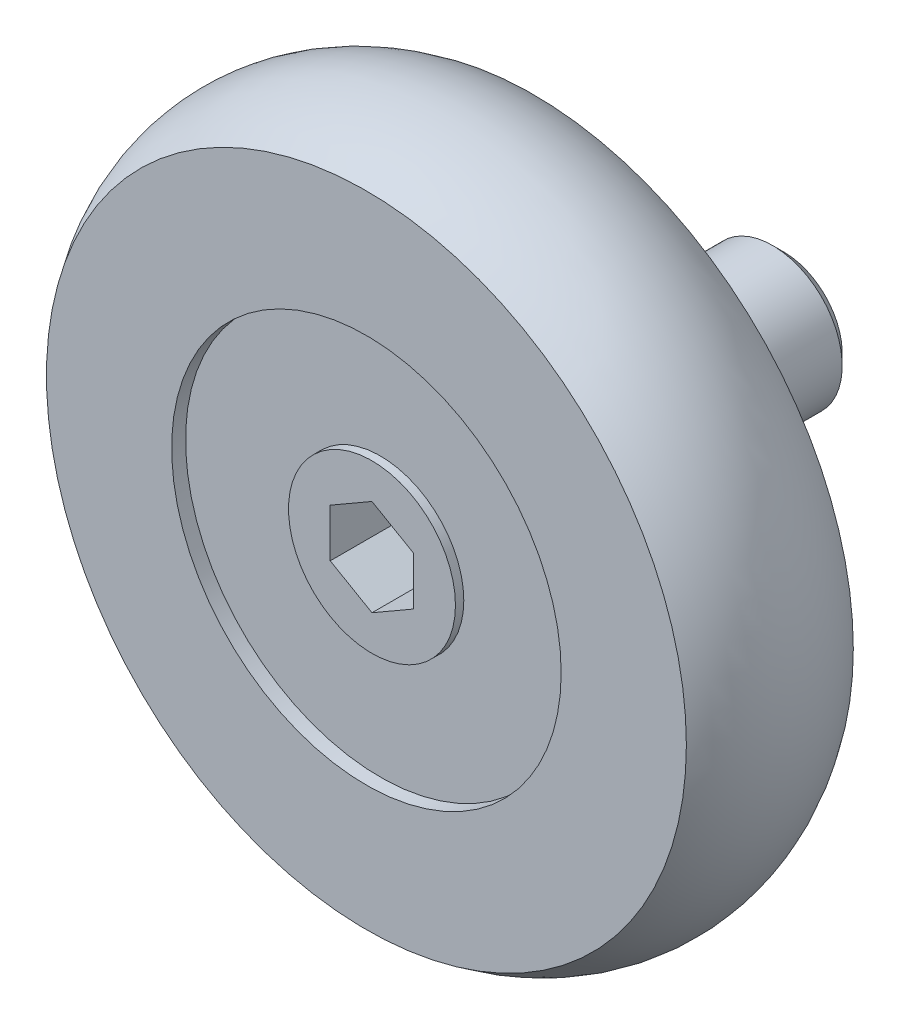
ISO-10303-21;
HEADER;
FILE_DESCRIPTION(('STEP AP214'),'2;1');
FILE_NAME('part.step','',(''),(''),'','','');
FILE_SCHEMA(('AUTOMOTIVE_DESIGN { 1 0 10303 214 1 1 1 1 }'));
ENDSEC;
DATA;
#1=APPLICATION_CONTEXT('core data for automotive mechanical design processes');
#2=APPLICATION_PROTOCOL_DEFINITION('international standard','automotive_design',2000,#1);
#3=PRODUCT_CONTEXT('',#1,'mechanical');
#4=PRODUCT('Part','Part','',(#3));
#5=PRODUCT_RELATED_PRODUCT_CATEGORY('part','',(#4));
#6=PRODUCT_DEFINITION_FORMATION('','',#4);
#7=PRODUCT_DEFINITION_CONTEXT('part definition',#1,'design');
#8=PRODUCT_DEFINITION('design','',#6,#7);
#9=PRODUCT_DEFINITION_SHAPE('','',#8);
#10=(LENGTH_UNIT() NAMED_UNIT(*) SI_UNIT(.MILLI.,.METRE.));
#11=(NAMED_UNIT(*) PLANE_ANGLE_UNIT() SI_UNIT($,.RADIAN.));
#12=(NAMED_UNIT(*) SI_UNIT($,.STERADIAN.) SOLID_ANGLE_UNIT());
#13=UNCERTAINTY_MEASURE_WITH_UNIT(LENGTH_MEASURE(1.E-05),#10,'distance_accuracy_value','');
#14=(GEOMETRIC_REPRESENTATION_CONTEXT(3) GLOBAL_UNCERTAINTY_ASSIGNED_CONTEXT((#13)) GLOBAL_UNIT_ASSIGNED_CONTEXT((#10,
#11,#12)) REPRESENTATION_CONTEXT('',''));
#15=CARTESIAN_POINT('',(0.,0.,0.));
#16=DIRECTION('',(0.,0.,1.));
#17=DIRECTION('',(1.,0.,0.));
#18=AXIS2_PLACEMENT_3D('',#15,#16,#17);
#19=CARTESIAN_POINT('',(0.,4.,0.));
#20=DIRECTION('',(0.,0.,1.));
#21=DIRECTION('',(1.,0.,0.));
#22=AXIS2_PLACEMENT_3D('',#19,#20,#21);
#23=PLANE('',#22);
#24=CARTESIAN_POINT('',(0.,0.,0.));
#25=DIRECTION('',(0.,0.,1.));
#26=DIRECTION('',(1.,0.,0.));
#27=AXIS2_PLACEMENT_3D('',#24,#25,#26);
#28=CIRCLE('',#27,4.);
#29=CARTESIAN_POINT('',(4.,0.,0.));
#30=VERTEX_POINT('',#29);
#31=EDGE_CURVE('E9',#30,#30,#28,.T.);
#32=ORIENTED_EDGE('',*,*,#31,.F.);
#33=EDGE_LOOP('',(#32));
#34=FACE_BOUND('',#33,.T.);
#35=CARTESIAN_POINT('',(0.,0.,0.));
#36=DIRECTION('',(0.,0.,-1.));
#37=DIRECTION('',(-1.,0.,0.));
#38=AXIS2_PLACEMENT_3D('',#35,#36,#37);
#39=CIRCLE('',#38,2.);
#40=CARTESIAN_POINT('',(-2.,0.,0.));
#41=VERTEX_POINT('',#40);
#42=EDGE_CURVE('E104',#41,#41,#39,.T.);
#43=ORIENTED_EDGE('',*,*,#42,.F.);
#44=EDGE_LOOP('',(#43));
#45=FACE_BOUND('',#44,.T.);
#46=ADVANCED_FACE('F14',(#34,#45),#23,.F.);
#47=CARTESIAN_POINT('',(0.,0.,10.));
#48=DIRECTION('',(0.,0.,1.));
#49=DIRECTION('',(1.,0.,0.));
#50=AXIS2_PLACEMENT_3D('',#47,#48,#49);
#51=CYLINDRICAL_SURFACE('',#50,4.);
#52=CARTESIAN_POINT('',(0.,0.,1.5));
#53=DIRECTION('',(0.,0.,1.));
#54=DIRECTION('',(1.,0.,0.));
#55=AXIS2_PLACEMENT_3D('',#52,#53,#54);
#56=CIRCLE('',#55,4.);
#57=CARTESIAN_POINT('',(4.,0.,1.5));
#58=VERTEX_POINT('',#57);
#59=EDGE_CURVE('E22',#58,#58,#56,.T.);
#60=ORIENTED_EDGE('',*,*,#59,.F.);
#61=EDGE_LOOP('',(#60));
#62=FACE_BOUND('',#61,.T.);
#63=ORIENTED_EDGE('',*,*,#31,.T.);
#64=EDGE_LOOP('',(#63));
#65=FACE_BOUND('',#64,.T.);
#66=ADVANCED_FACE('F150',(#62,#65),#51,.T.);
#67=CARTESIAN_POINT('',(0.,4.,1.5));
#68=DIRECTION('',(0.,0.,1.));
#69=DIRECTION('',(1.,0.,0.));
#70=AXIS2_PLACEMENT_3D('',#67,#68,#69);
#71=PLANE('',#70);
#72=CARTESIAN_POINT('',(0.,0.,1.5));
#73=DIRECTION('',(0.,0.,1.));
#74=DIRECTION('',(1.,0.,0.));
#75=AXIS2_PLACEMENT_3D('',#72,#73,#74);
#76=CIRCLE('',#75,7.);
#77=CARTESIAN_POINT('',(7.,0.,1.5));
#78=VERTEX_POINT('',#77);
#79=EDGE_CURVE('E143',#78,#78,#76,.T.);
#80=ORIENTED_EDGE('',*,*,#79,.F.);
#81=EDGE_LOOP('',(#80));
#82=FACE_BOUND('',#81,.T.);
#83=ORIENTED_EDGE('',*,*,#59,.T.);
#84=EDGE_LOOP('',(#83));
#85=FACE_BOUND('',#84,.T.);
#86=ADVANCED_FACE('F148',(#82,#85),#71,.F.);
#87=CARTESIAN_POINT('',(0.,0.,10.));
#88=DIRECTION('',(0.,0.,1.));
#89=DIRECTION('',(1.,0.,0.));
#90=AXIS2_PLACEMENT_3D('',#87,#88,#89);
#91=CYLINDRICAL_SURFACE('',#90,7.);
#92=CARTESIAN_POINT('',(0.,0.,1.));
#93=DIRECTION('',(0.,0.,1.));
#94=DIRECTION('',(1.,0.,0.));
#95=AXIS2_PLACEMENT_3D('',#92,#93,#94);
#96=CIRCLE('',#95,7.);
#97=CARTESIAN_POINT('',(7.,0.,1.));
#98=VERTEX_POINT('',#97);
#99=EDGE_CURVE('E140',#98,#98,#96,.T.);
#100=ORIENTED_EDGE('',*,*,#99,.F.);
#101=EDGE_LOOP('',(#100));
#102=FACE_BOUND('',#101,.T.);
#103=ORIENTED_EDGE('',*,*,#79,.T.);
#104=EDGE_LOOP('',(#103));
#105=FACE_BOUND('',#104,.T.);
#106=ADVANCED_FACE('F223',(#102,#105),#91,.F.);
#107=CARTESIAN_POINT('',(0.,11.5,1.));
#108=DIRECTION('',(0.,0.,1.));
#109=DIRECTION('',(1.,0.,0.));
#110=AXIS2_PLACEMENT_3D('',#107,#108,#109);
#111=PLANE('',#110);
#112=CARTESIAN_POINT('',(0.,0.,1.));
#113=DIRECTION('',(0.,0.,1.));
#114=DIRECTION('',(1.,0.,0.));
#115=AXIS2_PLACEMENT_3D('',#112,#113,#114);
#116=CIRCLE('',#115,11.5);
#117=CARTESIAN_POINT('',(11.5,0.,1.));
#118=VERTEX_POINT('',#117);
#119=EDGE_CURVE('E137',#118,#118,#116,.T.);
#120=ORIENTED_EDGE('',*,*,#119,.F.);
#121=EDGE_LOOP('',(#120));
#122=FACE_BOUND('',#121,.T.);
#123=ORIENTED_EDGE('',*,*,#99,.T.);
#124=EDGE_LOOP('',(#123));
#125=FACE_BOUND('',#124,.T.);
#126=ADVANCED_FACE('F219',(#122,#125),#111,.F.);
#127=CARTESIAN_POINT('',(0.,0.,4.));
#128=DIRECTION('',(0.,0.,1.));
#129=DIRECTION('',(1.,0.,0.));
#130=AXIS2_PLACEMENT_3D('',#127,#128,#129);
#131=TOROIDAL_SURFACE('',#130,7.5,5.);
#132=CARTESIAN_POINT('',(0.,0.,7.));
#133=DIRECTION('',(0.,0.,1.));
#134=DIRECTION('',(1.,0.,0.));
#135=AXIS2_PLACEMENT_3D('',#132,#133,#134);
#136=CIRCLE('',#135,11.5);
#137=CARTESIAN_POINT('',(11.5,0.,7.));
#138=VERTEX_POINT('',#137);
#139=EDGE_CURVE('E134',#138,#138,#136,.T.);
#140=ORIENTED_EDGE('',*,*,#139,.F.);
#141=EDGE_LOOP('',(#140));
#142=FACE_BOUND('',#141,.T.);
#143=ORIENTED_EDGE('',*,*,#119,.T.);
#144=EDGE_LOOP('',(#143));
#145=FACE_BOUND('',#144,.T.);
#146=ADVANCED_FACE('F215',(#142,#145),#131,.T.);
#147=CARTESIAN_POINT('',(0.,11.5,7.));
#148=DIRECTION('',(0.,0.,-1.));
#149=DIRECTION('',(-1.,0.,0.));
#150=AXIS2_PLACEMENT_3D('',#147,#148,#149);
#151=PLANE('',#150);
#152=CARTESIAN_POINT('',(0.,0.,7.));
#153=DIRECTION('',(0.,0.,1.));
#154=DIRECTION('',(1.,0.,0.));
#155=AXIS2_PLACEMENT_3D('',#152,#153,#154);
#156=CIRCLE('',#155,7.);
#157=CARTESIAN_POINT('',(7.,0.,7.));
#158=VERTEX_POINT('',#157);
#159=EDGE_CURVE('E131',#158,#158,#156,.T.);
#160=ORIENTED_EDGE('',*,*,#159,.F.);
#161=EDGE_LOOP('',(#160));
#162=FACE_BOUND('',#161,.T.);
#163=ORIENTED_EDGE('',*,*,#139,.T.);
#164=EDGE_LOOP('',(#163));
#165=FACE_BOUND('',#164,.T.);
#166=ADVANCED_FACE('F211',(#162,#165),#151,.F.);
#167=CARTESIAN_POINT('',(0.,0.,10.));
#168=DIRECTION('',(0.,0.,1.));
#169=DIRECTION('',(1.,0.,0.));
#170=AXIS2_PLACEMENT_3D('',#167,#168,#169);
#171=CYLINDRICAL_SURFACE('',#170,7.);
#172=CARTESIAN_POINT('',(0.,0.,6.5));
#173=DIRECTION('',(0.,0.,1.));
#174=DIRECTION('',(1.,0.,0.));
#175=AXIS2_PLACEMENT_3D('',#172,#173,#174);
#176=CIRCLE('',#175,7.);
#177=CARTESIAN_POINT('',(7.,0.,6.5));
#178=VERTEX_POINT('',#177);
#179=EDGE_CURVE('E128',#178,#178,#176,.T.);
#180=ORIENTED_EDGE('',*,*,#179,.F.);
#181=EDGE_LOOP('',(#180));
#182=FACE_BOUND('',#181,.T.);
#183=ORIENTED_EDGE('',*,*,#159,.T.);
#184=EDGE_LOOP('',(#183));
#185=FACE_BOUND('',#184,.T.);
#186=ADVANCED_FACE('F207',(#182,#185),#171,.F.);
#187=CARTESIAN_POINT('',(0.,3.,6.5));
#188=DIRECTION('',(0.,0.,-1.));
#189=DIRECTION('',(-1.,0.,0.));
#190=AXIS2_PLACEMENT_3D('',#187,#188,#189);
#191=PLANE('',#190);
#192=CARTESIAN_POINT('',(0.,0.,6.5));
#193=DIRECTION('',(0.,0.,1.));
#194=DIRECTION('',(1.,0.,0.));
#195=AXIS2_PLACEMENT_3D('',#192,#193,#194);
#196=CIRCLE('',#195,3.);
#197=CARTESIAN_POINT('',(3.,0.,6.5));
#198=VERTEX_POINT('',#197);
#199=EDGE_CURVE('E125',#198,#198,#196,.T.);
#200=ORIENTED_EDGE('',*,*,#199,.F.);
#201=EDGE_LOOP('',(#200));
#202=FACE_BOUND('',#201,.T.);
#203=ORIENTED_EDGE('',*,*,#179,.T.);
#204=EDGE_LOOP('',(#203));
#205=FACE_BOUND('',#204,.T.);
#206=ADVANCED_FACE('F203',(#202,#205),#191,.F.);
#207=CARTESIAN_POINT('',(0.,0.,10.));
#208=DIRECTION('',(0.,0.,1.));
#209=DIRECTION('',(1.,0.,0.));
#210=AXIS2_PLACEMENT_3D('',#207,#208,#209);
#211=CYLINDRICAL_SURFACE('',#210,3.);
#212=CARTESIAN_POINT('',(0.,0.,6.8));
#213=DIRECTION('',(0.,0.,1.));
#214=DIRECTION('',(1.,0.,0.));
#215=AXIS2_PLACEMENT_3D('',#212,#213,#214);
#216=CIRCLE('',#215,3.);
#217=CARTESIAN_POINT('',(3.,0.,6.8));
#218=VERTEX_POINT('',#217);
#219=EDGE_CURVE('E117',#218,#218,#216,.T.);
#220=ORIENTED_EDGE('',*,*,#219,.F.);
#221=EDGE_LOOP('',(#220));
#222=FACE_BOUND('',#221,.T.);
#223=ORIENTED_EDGE('',*,*,#199,.T.);
#224=EDGE_LOOP('',(#223));
#225=FACE_BOUND('',#224,.T.);
#226=ADVANCED_FACE('F200',(#222,#225),#211,.T.);
#227=CARTESIAN_POINT('',(0.,3.,6.8));
#228=DIRECTION('',(0.,0.,-1.));
#229=DIRECTION('',(-1.,0.,0.));
#230=AXIS2_PLACEMENT_3D('',#227,#228,#229);
#231=PLANE('',#230);
#232=DIRECTION('',(-0.866025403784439,-0.5,0.));
#233=VECTOR('',#232,1.);
#234=CARTESIAN_POINT('',(0.,1.73205080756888,6.8));
#235=LINE('',#234,#233);
#236=CARTESIAN_POINT('',(0.,1.73205080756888,6.8));
#237=VERTEX_POINT('',#236);
#238=CARTESIAN_POINT('',(-1.5,0.866025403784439,6.8));
#239=VERTEX_POINT('',#238);
#240=EDGE_CURVE('E103',#237,#239,#235,.T.);
#241=ORIENTED_EDGE('',*,*,#240,.F.);
#242=DIRECTION('',(-0.866025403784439,0.5,0.));
#243=VECTOR('',#242,1.);
#244=CARTESIAN_POINT('',(1.5,0.86602540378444,6.8));
#245=LINE('',#244,#243);
#246=CARTESIAN_POINT('',(1.5,0.86602540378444,6.8));
#247=VERTEX_POINT('',#246);
#248=EDGE_CURVE('E29',#247,#237,#245,.T.);
#249=ORIENTED_EDGE('',*,*,#248,.F.);
#250=DIRECTION('',(0.,1.,0.));
#251=VECTOR('',#250,1.);
#252=CARTESIAN_POINT('',(1.5,-0.866025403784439,6.8));
#253=LINE('',#252,#251);
#254=CARTESIAN_POINT('',(1.5,-0.866025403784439,6.8));
#255=VERTEX_POINT('',#254);
#256=EDGE_CURVE('E113',#255,#247,#253,.T.);
#257=ORIENTED_EDGE('',*,*,#256,.F.);
#258=DIRECTION('',(0.866025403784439,0.5,0.));
#259=VECTOR('',#258,1.);
#260=CARTESIAN_POINT('',(0.,-1.73205080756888,6.8));
#261=LINE('',#260,#259);
#262=CARTESIAN_POINT('',(0.,-1.73205080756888,6.8));
#263=VERTEX_POINT('',#262);
#264=EDGE_CURVE('E111',#263,#255,#261,.T.);
#265=ORIENTED_EDGE('',*,*,#264,.F.);
#266=DIRECTION('',(0.866025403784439,-0.5,0.));
#267=VECTOR('',#266,1.);
#268=CARTESIAN_POINT('',(-1.5,-0.866025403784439,6.8));
#269=LINE('',#268,#267);
#270=CARTESIAN_POINT('',(-1.5,-0.866025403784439,6.8));
#271=VERTEX_POINT('',#270);
#272=EDGE_CURVE('E77',#271,#263,#269,.T.);
#273=ORIENTED_EDGE('',*,*,#272,.F.);
#274=DIRECTION('',(0.,-1.,0.));
#275=VECTOR('',#274,1.);
#276=CARTESIAN_POINT('',(-1.5,0.866025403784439,6.8));
#277=LINE('',#276,#275);
#278=EDGE_CURVE('E107',#239,#271,#277,.T.);
#279=ORIENTED_EDGE('',*,*,#278,.F.);
#280=EDGE_LOOP('',(#241,#249,#257,#265,#273,#279));
#281=FACE_BOUND('',#280,.T.);
#282=ORIENTED_EDGE('',*,*,#219,.T.);
#283=EDGE_LOOP('',(#282));
#284=FACE_BOUND('',#283,.T.);
#285=ADVANCED_FACE('F175',(#281,#284),#231,.F.);
#286=CARTESIAN_POINT('',(1.5,0.86602540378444,4.3));
#287=DIRECTION('',(0.5,0.866025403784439,0.));
#288=DIRECTION('',(-0.866025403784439,0.5,0.));
#289=AXIS2_PLACEMENT_3D('',#286,#287,#288);
#290=PLANE('',#289);
#291=ORIENTED_EDGE('',*,*,#248,.T.);
#292=DIRECTION('',(0.,0.,1.));
#293=VECTOR('',#292,1.);
#294=CARTESIAN_POINT('',(0.,1.73205080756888,4.3));
#295=LINE('',#294,#293);
#296=CARTESIAN_POINT('',(0.,1.73205080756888,4.3));
#297=VERTEX_POINT('',#296);
#298=EDGE_CURVE('E59',#297,#237,#295,.T.);
#299=ORIENTED_EDGE('',*,*,#298,.F.);
#300=DIRECTION('',(-0.866025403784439,0.5,0.));
#301=VECTOR('',#300,1.);
#302=CARTESIAN_POINT('',(1.5,0.86602540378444,4.3));
#303=LINE('',#302,#301);
#304=CARTESIAN_POINT('',(1.5,0.86602540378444,4.3));
#305=VERTEX_POINT('',#304);
#306=EDGE_CURVE('E115',#305,#297,#303,.T.);
#307=ORIENTED_EDGE('',*,*,#306,.F.);
#308=DIRECTION('',(0.,0.,1.));
#309=VECTOR('',#308,1.);
#310=CARTESIAN_POINT('',(1.5,0.86602540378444,4.3));
#311=LINE('',#310,#309);
#312=EDGE_CURVE('E37',#305,#247,#311,.T.);
#313=ORIENTED_EDGE('',*,*,#312,.T.);
#314=EDGE_LOOP('',(#291,#299,#307,#313));
#315=FACE_BOUND('',#314,.T.);
#316=ADVANCED_FACE('F180',(#315),#290,.F.);
#317=CARTESIAN_POINT('',(1.5,-0.866025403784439,4.3));
#318=DIRECTION('',(1.,0.,0.));
#319=DIRECTION('',(0.,1.,0.));
#320=AXIS2_PLACEMENT_3D('',#317,#318,#319);
#321=PLANE('',#320);
#322=ORIENTED_EDGE('',*,*,#256,.T.);
#323=ORIENTED_EDGE('',*,*,#312,.F.);
#324=DIRECTION('',(0.,1.,0.));
#325=VECTOR('',#324,1.);
#326=CARTESIAN_POINT('',(1.5,-0.866025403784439,4.3));
#327=LINE('',#326,#325);
#328=CARTESIAN_POINT('',(1.5,-0.866025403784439,4.3));
#329=VERTEX_POINT('',#328);
#330=EDGE_CURVE('E89',#329,#305,#327,.T.);
#331=ORIENTED_EDGE('',*,*,#330,.F.);
#332=DIRECTION('',(0.,0.,1.));
#333=VECTOR('',#332,1.);
#334=CARTESIAN_POINT('',(1.5,-0.866025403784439,4.3));
#335=LINE('',#334,#333);
#336=EDGE_CURVE('E81',#329,#255,#335,.T.);
#337=ORIENTED_EDGE('',*,*,#336,.T.);
#338=EDGE_LOOP('',(#322,#323,#331,#337));
#339=FACE_BOUND('',#338,.T.);
#340=ADVANCED_FACE('F178',(#339),#321,.F.);
#341=CARTESIAN_POINT('',(0.,-1.73205080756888,4.3));
#342=DIRECTION('',(0.5,-0.866025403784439,0.));
#343=DIRECTION('',(0.866025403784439,0.5,0.));
#344=AXIS2_PLACEMENT_3D('',#341,#342,#343);
#345=PLANE('',#344);
#346=ORIENTED_EDGE('',*,*,#264,.T.);
#347=ORIENTED_EDGE('',*,*,#336,.F.);
#348=DIRECTION('',(0.866025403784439,0.5,0.));
#349=VECTOR('',#348,1.);
#350=CARTESIAN_POINT('',(0.,-1.73205080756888,4.3));
#351=LINE('',#350,#349);
#352=CARTESIAN_POINT('',(0.,-1.73205080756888,4.3));
#353=VERTEX_POINT('',#352);
#354=EDGE_CURVE('E85',#353,#329,#351,.T.);
#355=ORIENTED_EDGE('',*,*,#354,.F.);
#356=DIRECTION('',(0.,0.,1.));
#357=VECTOR('',#356,1.);
#358=CARTESIAN_POINT('',(0.,-1.73205080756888,4.3));
#359=LINE('',#358,#357);
#360=EDGE_CURVE('E70',#353,#263,#359,.T.);
#361=ORIENTED_EDGE('',*,*,#360,.T.);
#362=EDGE_LOOP('',(#346,#347,#355,#361));
#363=FACE_BOUND('',#362,.T.);
#364=ADVANCED_FACE('F86',(#363),#345,.F.);
#365=CARTESIAN_POINT('',(-1.5,-0.866025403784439,4.3));
#366=DIRECTION('',(-0.5,-0.866025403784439,0.));
#367=DIRECTION('',(0.866025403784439,-0.5,0.));
#368=AXIS2_PLACEMENT_3D('',#365,#366,#367);
#369=PLANE('',#368);
#370=ORIENTED_EDGE('',*,*,#272,.T.);
#371=ORIENTED_EDGE('',*,*,#360,.F.);
#372=DIRECTION('',(0.866025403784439,-0.5,0.));
#373=VECTOR('',#372,1.);
#374=CARTESIAN_POINT('',(-1.5,-0.866025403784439,4.3));
#375=LINE('',#374,#373);
#376=CARTESIAN_POINT('',(-1.5,-0.866025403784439,4.3));
#377=VERTEX_POINT('',#376);
#378=EDGE_CURVE('E74',#377,#353,#375,.T.);
#379=ORIENTED_EDGE('',*,*,#378,.F.);
#380=DIRECTION('',(0.,0.,1.));
#381=VECTOR('',#380,1.);
#382=CARTESIAN_POINT('',(-1.5,-0.866025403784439,4.3));
#383=LINE('',#382,#381);
#384=EDGE_CURVE('E82',#377,#271,#383,.T.);
#385=ORIENTED_EDGE('',*,*,#384,.T.);
#386=EDGE_LOOP('',(#370,#371,#379,#385));
#387=FACE_BOUND('',#386,.T.);
#388=ADVANCED_FACE('F72',(#387),#369,.F.);
#389=CARTESIAN_POINT('',(-1.5,0.866025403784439,4.3));
#390=DIRECTION('',(-1.,0.,0.));
#391=DIRECTION('',(0.,-1.,0.));
#392=AXIS2_PLACEMENT_3D('',#389,#390,#391);
#393=PLANE('',#392);
#394=ORIENTED_EDGE('',*,*,#278,.T.);
#395=ORIENTED_EDGE('',*,*,#384,.F.);
#396=DIRECTION('',(0.,-1.,0.));
#397=VECTOR('',#396,1.);
#398=CARTESIAN_POINT('',(-1.5,0.866025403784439,4.3));
#399=LINE('',#398,#397);
#400=CARTESIAN_POINT('',(-1.5,0.866025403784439,4.3));
#401=VERTEX_POINT('',#400);
#402=EDGE_CURVE('E95',#401,#377,#399,.T.);
#403=ORIENTED_EDGE('',*,*,#402,.F.);
#404=DIRECTION('',(0.,0.,1.));
#405=VECTOR('',#404,1.);
#406=CARTESIAN_POINT('',(-1.5,0.866025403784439,4.3));
#407=LINE('',#406,#405);
#408=EDGE_CURVE('E120',#401,#239,#407,.T.);
#409=ORIENTED_EDGE('',*,*,#408,.T.);
#410=EDGE_LOOP('',(#394,#395,#403,#409));
#411=FACE_BOUND('',#410,.T.);
#412=ADVANCED_FACE('F173',(#411),#393,.F.);
#413=CARTESIAN_POINT('',(0.,1.73205080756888,4.3));
#414=DIRECTION('',(-0.5,0.866025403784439,0.));
#415=DIRECTION('',(-0.866025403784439,-0.5,0.));
#416=AXIS2_PLACEMENT_3D('',#413,#414,#415);
#417=PLANE('',#416);
#418=ORIENTED_EDGE('',*,*,#240,.T.);
#419=ORIENTED_EDGE('',*,*,#408,.F.);
#420=DIRECTION('',(-0.866025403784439,-0.5,0.));
#421=VECTOR('',#420,1.);
#422=CARTESIAN_POINT('',(0.,1.73205080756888,4.3));
#423=LINE('',#422,#421);
#424=EDGE_CURVE('E97',#297,#401,#423,.T.);
#425=ORIENTED_EDGE('',*,*,#424,.F.);
#426=ORIENTED_EDGE('',*,*,#298,.T.);
#427=EDGE_LOOP('',(#418,#419,#425,#426));
#428=FACE_BOUND('',#427,.T.);
#429=ADVANCED_FACE('F169',(#428),#417,.F.);
#430=CARTESIAN_POINT('',(0.,0.,4.3));
#431=DIRECTION('',(0.,0.,1.));
#432=DIRECTION('',(1.,0.,0.));
#433=AXIS2_PLACEMENT_3D('',#430,#431,#432);
#434=PLANE('',#433);
#435=ORIENTED_EDGE('',*,*,#306,.T.);
#436=ORIENTED_EDGE('',*,*,#424,.T.);
#437=ORIENTED_EDGE('',*,*,#402,.T.);
#438=ORIENTED_EDGE('',*,*,#378,.T.);
#439=ORIENTED_EDGE('',*,*,#354,.T.);
#440=ORIENTED_EDGE('',*,*,#330,.T.);
#441=EDGE_LOOP('',(#435,#436,#437,#438,#439,#440));
#442=FACE_BOUND('',#441,.T.);
#443=ADVANCED_FACE('F92',(#442),#434,.T.);
#444=CARTESIAN_POINT('',(0.,0.,-8.));
#445=DIRECTION('',(0.,0.,-1.));
#446=DIRECTION('',(-1.,0.,0.));
#447=AXIS2_PLACEMENT_3D('',#444,#445,#446);
#448=CYLINDRICAL_SURFACE('',#447,2.);
#449=CARTESIAN_POINT('',(0.,0.,-1.6));
#450=DIRECTION('',(0.,0.,-1.));
#451=DIRECTION('',(-1.,0.,0.));
#452=AXIS2_PLACEMENT_3D('',#449,#450,#451);
#453=CIRCLE('',#452,2.);
#454=CARTESIAN_POINT('',(-2.,0.,-1.6));
#455=VERTEX_POINT('',#454);
#456=EDGE_CURVE('E161',#455,#455,#453,.T.);
#457=ORIENTED_EDGE('',*,*,#456,.F.);
#458=EDGE_LOOP('',(#457));
#459=FACE_BOUND('',#458,.T.);
#460=ORIENTED_EDGE('',*,*,#42,.T.);
#461=EDGE_LOOP('',(#460));
#462=FACE_BOUND('',#461,.T.);
#463=ADVANCED_FACE('F325',(#459,#462),#448,.T.);
#464=CARTESIAN_POINT('',(0.,2.,-1.6));
#465=DIRECTION('',(0.,0.,-1.));
#466=DIRECTION('',(-1.,0.,0.));
#467=AXIS2_PLACEMENT_3D('',#464,#465,#466);
#468=PLANE('',#467);
#469=CARTESIAN_POINT('',(0.,0.,-1.6));
#470=DIRECTION('',(0.,0.,-1.));
#471=DIRECTION('',(-1.,0.,0.));
#472=AXIS2_PLACEMENT_3D('',#469,#470,#471);
#473=CIRCLE('',#472,2.5);
#474=CARTESIAN_POINT('',(-2.5,0.,-1.6));
#475=VERTEX_POINT('',#474);
#476=EDGE_CURVE('E164',#475,#475,#473,.T.);
#477=ORIENTED_EDGE('',*,*,#476,.F.);
#478=EDGE_LOOP('',(#477));
#479=FACE_BOUND('',#478,.T.);
#480=ORIENTED_EDGE('',*,*,#456,.T.);
#481=EDGE_LOOP('',(#480));
#482=FACE_BOUND('',#481,.T.);
#483=ADVANCED_FACE('F334',(#479,#482),#468,.F.);
#484=CARTESIAN_POINT('',(0.,0.,-8.));
#485=DIRECTION('',(0.,0.,-1.));
#486=DIRECTION('',(-1.,0.,0.));
#487=AXIS2_PLACEMENT_3D('',#484,#485,#486);
#488=CYLINDRICAL_SURFACE('',#487,2.5);
#489=CARTESIAN_POINT('',(0.,0.,-7.6));
#490=DIRECTION('',(0.,0.,-1.));
#491=DIRECTION('',(-1.,0.,0.));
#492=AXIS2_PLACEMENT_3D('',#489,#490,#491);
#493=CIRCLE('',#492,2.5);
#494=CARTESIAN_POINT('',(-2.5,0.,-7.6));
#495=VERTEX_POINT('',#494);
#496=EDGE_CURVE('E378',#495,#495,#493,.T.);
#497=ORIENTED_EDGE('',*,*,#496,.F.);
#498=EDGE_LOOP('',(#497));
#499=FACE_BOUND('',#498,.T.);
#500=ORIENTED_EDGE('',*,*,#476,.T.);
#501=EDGE_LOOP('',(#500));
#502=FACE_BOUND('',#501,.T.);
#503=ADVANCED_FACE('F343',(#499,#502),#488,.T.);
#504=CARTESIAN_POINT('',(0.,0.,-7.6));
#505=DIRECTION('',(0.,0.,1.));
#506=DIRECTION('',(1.,0.,0.));
#507=AXIS2_PLACEMENT_3D('',#504,#505,#506);
#508=CONICAL_SURFACE('',#507,2.5,0.785398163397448);
#509=CARTESIAN_POINT('',(0.,0.,-8.));
#510=DIRECTION('',(0.,0.,-1.));
#511=DIRECTION('',(-1.,0.,0.));
#512=AXIS2_PLACEMENT_3D('',#509,#510,#511);
#513=CIRCLE('',#512,2.1);
#514=CARTESIAN_POINT('',(-2.1,0.,-8.));
#515=VERTEX_POINT('',#514);
#516=EDGE_CURVE('E377',#515,#515,#513,.T.);
#517=ORIENTED_EDGE('',*,*,#516,.F.);
#518=EDGE_LOOP('',(#517));
#519=FACE_BOUND('',#518,.T.);
#520=ORIENTED_EDGE('',*,*,#496,.T.);
#521=EDGE_LOOP('',(#520));
#522=FACE_BOUND('',#521,.T.);
#523=ADVANCED_FACE('F353',(#519,#522),#508,.T.);
#524=CARTESIAN_POINT('',(0.,0.,-8.));
#525=DIRECTION('',(0.,0.,1.));
#526=DIRECTION('',(1.,0.,0.));
#527=AXIS2_PLACEMENT_3D('',#524,#525,#526);
#528=PLANE('',#527);
#529=ORIENTED_EDGE('',*,*,#516,.T.);
#530=EDGE_LOOP('',(#529));
#531=FACE_BOUND('',#530,.T.);
#532=ADVANCED_FACE('F16',(#531),#528,.F.);
#533=CLOSED_SHELL('',(#46,#66,#86,#106,#126,#146,#166,#186,#206,#226,#285,#316,#340,#364,#388,
#412,#429,#443,#463,#483,#503,#523,#532));
#534=MANIFOLD_SOLID_BREP('B1',#533);
#535=ADVANCED_BREP_SHAPE_REPRESENTATION('',(#18,#534),#14);
#536=SHAPE_DEFINITION_REPRESENTATION(#9,#535);
ENDSEC;
END-ISO-10303-21;
